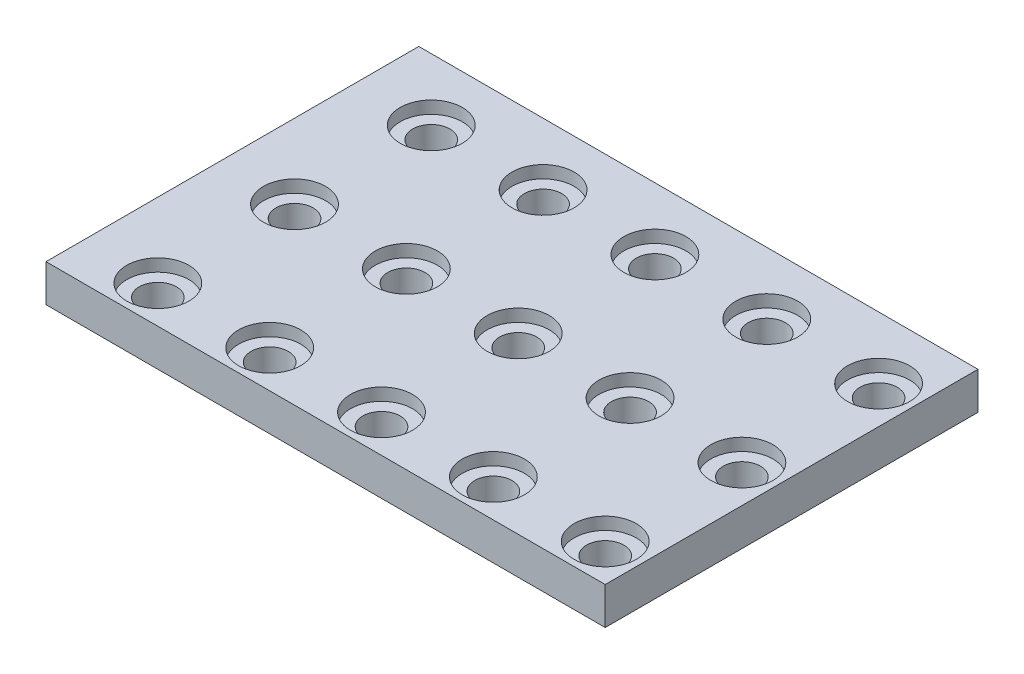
ISO-10303-21;
HEADER;
FILE_DESCRIPTION(('STEP AP214'),'2;1');
FILE_NAME('part.step','',(''),(''),'','','');
FILE_SCHEMA(('AUTOMOTIVE_DESIGN { 1 0 10303 214 1 1 1 1 }'));
ENDSEC;
DATA;
#1=APPLICATION_CONTEXT('core data for automotive mechanical design processes');
#2=APPLICATION_PROTOCOL_DEFINITION('international standard','automotive_design',2000,#1);
#3=PRODUCT_CONTEXT('',#1,'mechanical');
#4=PRODUCT('Part','Part','',(#3));
#5=PRODUCT_RELATED_PRODUCT_CATEGORY('part','',(#4));
#6=PRODUCT_DEFINITION_FORMATION('','',#4);
#7=PRODUCT_DEFINITION_CONTEXT('part definition',#1,'design');
#8=PRODUCT_DEFINITION('design','',#6,#7);
#9=PRODUCT_DEFINITION_SHAPE('','',#8);
#10=(LENGTH_UNIT() NAMED_UNIT(*) SI_UNIT(.MILLI.,.METRE.));
#11=(NAMED_UNIT(*) PLANE_ANGLE_UNIT() SI_UNIT($,.RADIAN.));
#12=(NAMED_UNIT(*) SI_UNIT($,.STERADIAN.) SOLID_ANGLE_UNIT());
#13=UNCERTAINTY_MEASURE_WITH_UNIT(LENGTH_MEASURE(1.E-05),#10,'distance_accuracy_value','');
#14=(GEOMETRIC_REPRESENTATION_CONTEXT(3) GLOBAL_UNCERTAINTY_ASSIGNED_CONTEXT((#13)) GLOBAL_UNIT_ASSIGNED_CONTEXT((#10,
#11,#12)) REPRESENTATION_CONTEXT('',''));
#15=CARTESIAN_POINT('',(0.,0.,0.));
#16=DIRECTION('',(0.,0.,1.));
#17=DIRECTION('',(1.,0.,0.));
#18=AXIS2_PLACEMENT_3D('',#15,#16,#17);
#19=CARTESIAN_POINT('',(6.00000000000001,0.,5.));
#20=DIRECTION('',(0.,1.,0.));
#21=DIRECTION('',(0.,0.,1.));
#22=AXIS2_PLACEMENT_3D('',#19,#20,#21);
#23=CYLINDRICAL_SURFACE('',#22,1.5);
#24=CARTESIAN_POINT('',(6.00000000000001,0.,5.));
#25=DIRECTION('',(0.,1.,0.));
#26=DIRECTION('',(0.,0.,1.));
#27=AXIS2_PLACEMENT_3D('',#24,#25,#26);
#28=CIRCLE('',#27,1.5);
#29=CARTESIAN_POINT('',(6.00000000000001,0.,6.50000000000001));
#30=VERTEX_POINT('',#29);
#31=EDGE_CURVE('E119',#30,#30,#28,.T.);
#32=ORIENTED_EDGE('',*,*,#31,.F.);
#33=EDGE_LOOP('',(#32));
#34=FACE_BOUND('',#33,.T.);
#35=CARTESIAN_POINT('',(6.00000000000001,2.,5.));
#36=DIRECTION('',(0.,1.,0.));
#37=DIRECTION('',(0.,0.,1.));
#38=AXIS2_PLACEMENT_3D('',#35,#36,#37);
#39=CIRCLE('',#38,1.5);
#40=CARTESIAN_POINT('',(6.00000000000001,2.,6.50000000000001));
#41=VERTEX_POINT('',#40);
#42=EDGE_CURVE('E37',#41,#41,#39,.F.);
#43=ORIENTED_EDGE('',*,*,#42,.F.);
#44=EDGE_LOOP('',(#43));
#45=FACE_BOUND('',#44,.T.);
#46=ADVANCED_FACE('F33',(#34,#45),#23,.F.);
#47=CARTESIAN_POINT('',(6.00000000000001,0.,16.));
#48=DIRECTION('',(0.,1.,0.));
#49=DIRECTION('',(0.,0.,1.));
#50=AXIS2_PLACEMENT_3D('',#47,#48,#49);
#51=CYLINDRICAL_SURFACE('',#50,1.5);
#52=CARTESIAN_POINT('',(6.00000000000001,0.,16.));
#53=DIRECTION('',(0.,1.,0.));
#54=DIRECTION('',(0.,0.,1.));
#55=AXIS2_PLACEMENT_3D('',#52,#53,#54);
#56=CIRCLE('',#55,1.5);
#57=CARTESIAN_POINT('',(6.00000000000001,0.,17.5));
#58=VERTEX_POINT('',#57);
#59=EDGE_CURVE('E240',#58,#58,#56,.T.);
#60=ORIENTED_EDGE('',*,*,#59,.F.);
#61=EDGE_LOOP('',(#60));
#62=FACE_BOUND('',#61,.T.);
#63=CARTESIAN_POINT('',(6.00000000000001,2.,16.));
#64=DIRECTION('',(0.,1.,0.));
#65=DIRECTION('',(0.,0.,1.));
#66=AXIS2_PLACEMENT_3D('',#63,#64,#65);
#67=CIRCLE('',#66,1.5);
#68=CARTESIAN_POINT('',(6.00000000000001,2.,17.5));
#69=VERTEX_POINT('',#68);
#70=EDGE_CURVE('E175',#69,#69,#67,.F.);
#71=ORIENTED_EDGE('',*,*,#70,.F.);
#72=EDGE_LOOP('',(#71));
#73=FACE_BOUND('',#72,.T.);
#74=ADVANCED_FACE('F309',(#62,#73),#51,.F.);
#75=CARTESIAN_POINT('',(6.00000000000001,0.,27.));
#76=DIRECTION('',(0.,1.,0.));
#77=DIRECTION('',(0.,0.,1.));
#78=AXIS2_PLACEMENT_3D('',#75,#76,#77);
#79=CYLINDRICAL_SURFACE('',#78,1.5);
#80=CARTESIAN_POINT('',(6.00000000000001,0.,27.));
#81=DIRECTION('',(0.,1.,0.));
#82=DIRECTION('',(0.,0.,1.));
#83=AXIS2_PLACEMENT_3D('',#80,#81,#82);
#84=CIRCLE('',#83,1.5);
#85=CARTESIAN_POINT('',(6.00000000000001,0.,28.5));
#86=VERTEX_POINT('',#85);
#87=EDGE_CURVE('E243',#86,#86,#84,.T.);
#88=ORIENTED_EDGE('',*,*,#87,.F.);
#89=EDGE_LOOP('',(#88));
#90=FACE_BOUND('',#89,.T.);
#91=CARTESIAN_POINT('',(6.00000000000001,2.,27.));
#92=DIRECTION('',(0.,1.,0.));
#93=DIRECTION('',(0.,0.,1.));
#94=AXIS2_PLACEMENT_3D('',#91,#92,#93);
#95=CIRCLE('',#94,1.5);
#96=CARTESIAN_POINT('',(6.00000000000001,2.,28.5));
#97=VERTEX_POINT('',#96);
#98=EDGE_CURVE('E171',#97,#97,#95,.F.);
#99=ORIENTED_EDGE('',*,*,#98,.F.);
#100=EDGE_LOOP('',(#99));
#101=FACE_BOUND('',#100,.T.);
#102=ADVANCED_FACE('F315',(#90,#101),#79,.F.);
#103=CARTESIAN_POINT('',(15.,0.,5.));
#104=DIRECTION('',(0.,1.,0.));
#105=DIRECTION('',(0.,0.,1.));
#106=AXIS2_PLACEMENT_3D('',#103,#104,#105);
#107=CYLINDRICAL_SURFACE('',#106,1.5);
#108=CARTESIAN_POINT('',(15.,0.,5.));
#109=DIRECTION('',(0.,1.,0.));
#110=DIRECTION('',(0.,0.,1.));
#111=AXIS2_PLACEMENT_3D('',#108,#109,#110);
#112=CIRCLE('',#111,1.5);
#113=CARTESIAN_POINT('',(15.,0.,6.50000000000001));
#114=VERTEX_POINT('',#113);
#115=EDGE_CURVE('E246',#114,#114,#112,.T.);
#116=ORIENTED_EDGE('',*,*,#115,.F.);
#117=EDGE_LOOP('',(#116));
#118=FACE_BOUND('',#117,.T.);
#119=CARTESIAN_POINT('',(15.,2.,5.));
#120=DIRECTION('',(0.,1.,0.));
#121=DIRECTION('',(0.,0.,1.));
#122=AXIS2_PLACEMENT_3D('',#119,#120,#121);
#123=CIRCLE('',#122,1.5);
#124=CARTESIAN_POINT('',(15.,2.,6.50000000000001));
#125=VERTEX_POINT('',#124);
#126=EDGE_CURVE('E166',#125,#125,#123,.F.);
#127=ORIENTED_EDGE('',*,*,#126,.F.);
#128=EDGE_LOOP('',(#127));
#129=FACE_BOUND('',#128,.T.);
#130=ADVANCED_FACE('F326',(#118,#129),#107,.F.);
#131=CARTESIAN_POINT('',(15.,0.,16.));
#132=DIRECTION('',(0.,1.,0.));
#133=DIRECTION('',(0.,0.,1.));
#134=AXIS2_PLACEMENT_3D('',#131,#132,#133);
#135=CYLINDRICAL_SURFACE('',#134,1.5);
#136=CARTESIAN_POINT('',(15.,0.,16.));
#137=DIRECTION('',(0.,1.,0.));
#138=DIRECTION('',(0.,0.,1.));
#139=AXIS2_PLACEMENT_3D('',#136,#137,#138);
#140=CIRCLE('',#139,1.5);
#141=CARTESIAN_POINT('',(15.,0.,17.5));
#142=VERTEX_POINT('',#141);
#143=EDGE_CURVE('E249',#142,#142,#140,.T.);
#144=ORIENTED_EDGE('',*,*,#143,.F.);
#145=EDGE_LOOP('',(#144));
#146=FACE_BOUND('',#145,.T.);
#147=CARTESIAN_POINT('',(15.,2.,16.));
#148=DIRECTION('',(0.,1.,0.));
#149=DIRECTION('',(0.,0.,1.));
#150=AXIS2_PLACEMENT_3D('',#147,#148,#149);
#151=CIRCLE('',#150,1.5);
#152=CARTESIAN_POINT('',(15.,2.,17.5));
#153=VERTEX_POINT('',#152);
#154=EDGE_CURVE('E161',#153,#153,#151,.F.);
#155=ORIENTED_EDGE('',*,*,#154,.F.);
#156=EDGE_LOOP('',(#155));
#157=FACE_BOUND('',#156,.T.);
#158=ADVANCED_FACE('F330',(#146,#157),#135,.F.);
#159=CARTESIAN_POINT('',(15.,0.,27.));
#160=DIRECTION('',(0.,1.,0.));
#161=DIRECTION('',(0.,0.,1.));
#162=AXIS2_PLACEMENT_3D('',#159,#160,#161);
#163=CYLINDRICAL_SURFACE('',#162,1.5);
#164=CARTESIAN_POINT('',(15.,0.,27.));
#165=DIRECTION('',(0.,1.,0.));
#166=DIRECTION('',(0.,0.,1.));
#167=AXIS2_PLACEMENT_3D('',#164,#165,#166);
#168=CIRCLE('',#167,1.5);
#169=CARTESIAN_POINT('',(15.,0.,28.5));
#170=VERTEX_POINT('',#169);
#171=EDGE_CURVE('E252',#170,#170,#168,.T.);
#172=ORIENTED_EDGE('',*,*,#171,.F.);
#173=EDGE_LOOP('',(#172));
#174=FACE_BOUND('',#173,.T.);
#175=CARTESIAN_POINT('',(15.,2.,27.));
#176=DIRECTION('',(0.,1.,0.));
#177=DIRECTION('',(0.,0.,1.));
#178=AXIS2_PLACEMENT_3D('',#175,#176,#177);
#179=CIRCLE('',#178,1.5);
#180=CARTESIAN_POINT('',(15.,2.,28.5));
#181=VERTEX_POINT('',#180);
#182=EDGE_CURVE('E156',#181,#181,#179,.F.);
#183=ORIENTED_EDGE('',*,*,#182,.F.);
#184=EDGE_LOOP('',(#183));
#185=FACE_BOUND('',#184,.T.);
#186=ADVANCED_FACE('F334',(#174,#185),#163,.F.);
#187=CARTESIAN_POINT('',(24.,0.,5.));
#188=DIRECTION('',(0.,1.,0.));
#189=DIRECTION('',(0.,0.,1.));
#190=AXIS2_PLACEMENT_3D('',#187,#188,#189);
#191=CYLINDRICAL_SURFACE('',#190,1.5);
#192=CARTESIAN_POINT('',(24.,0.,5.));
#193=DIRECTION('',(0.,1.,0.));
#194=DIRECTION('',(0.,0.,1.));
#195=AXIS2_PLACEMENT_3D('',#192,#193,#194);
#196=CIRCLE('',#195,1.5);
#197=CARTESIAN_POINT('',(24.,0.,6.50000000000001));
#198=VERTEX_POINT('',#197);
#199=EDGE_CURVE('E255',#198,#198,#196,.T.);
#200=ORIENTED_EDGE('',*,*,#199,.F.);
#201=EDGE_LOOP('',(#200));
#202=FACE_BOUND('',#201,.T.);
#203=CARTESIAN_POINT('',(24.,2.,5.));
#204=DIRECTION('',(0.,1.,0.));
#205=DIRECTION('',(0.,0.,1.));
#206=AXIS2_PLACEMENT_3D('',#203,#204,#205);
#207=CIRCLE('',#206,1.5);
#208=CARTESIAN_POINT('',(24.,2.,6.50000000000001));
#209=VERTEX_POINT('',#208);
#210=EDGE_CURVE('E151',#209,#209,#207,.F.);
#211=ORIENTED_EDGE('',*,*,#210,.F.);
#212=EDGE_LOOP('',(#211));
#213=FACE_BOUND('',#212,.T.);
#214=ADVANCED_FACE('F338',(#202,#213),#191,.F.);
#215=CARTESIAN_POINT('',(24.,0.,16.));
#216=DIRECTION('',(0.,1.,0.));
#217=DIRECTION('',(0.,0.,1.));
#218=AXIS2_PLACEMENT_3D('',#215,#216,#217);
#219=CYLINDRICAL_SURFACE('',#218,1.5);
#220=CARTESIAN_POINT('',(24.,0.,16.));
#221=DIRECTION('',(0.,1.,0.));
#222=DIRECTION('',(0.,0.,1.));
#223=AXIS2_PLACEMENT_3D('',#220,#221,#222);
#224=CIRCLE('',#223,1.5);
#225=CARTESIAN_POINT('',(24.,0.,17.5));
#226=VERTEX_POINT('',#225);
#227=EDGE_CURVE('E258',#226,#226,#224,.T.);
#228=ORIENTED_EDGE('',*,*,#227,.F.);
#229=EDGE_LOOP('',(#228));
#230=FACE_BOUND('',#229,.T.);
#231=CARTESIAN_POINT('',(24.,2.,16.));
#232=DIRECTION('',(0.,1.,0.));
#233=DIRECTION('',(0.,0.,1.));
#234=AXIS2_PLACEMENT_3D('',#231,#232,#233);
#235=CIRCLE('',#234,1.5);
#236=CARTESIAN_POINT('',(24.,2.,17.5));
#237=VERTEX_POINT('',#236);
#238=EDGE_CURVE('E146',#237,#237,#235,.F.);
#239=ORIENTED_EDGE('',*,*,#238,.F.);
#240=EDGE_LOOP('',(#239));
#241=FACE_BOUND('',#240,.T.);
#242=ADVANCED_FACE('F342',(#230,#241),#219,.F.);
#243=CARTESIAN_POINT('',(24.,0.,27.));
#244=DIRECTION('',(0.,1.,0.));
#245=DIRECTION('',(0.,0.,1.));
#246=AXIS2_PLACEMENT_3D('',#243,#244,#245);
#247=CYLINDRICAL_SURFACE('',#246,1.5);
#248=CARTESIAN_POINT('',(24.,0.,27.));
#249=DIRECTION('',(0.,1.,0.));
#250=DIRECTION('',(0.,0.,1.));
#251=AXIS2_PLACEMENT_3D('',#248,#249,#250);
#252=CIRCLE('',#251,1.5);
#253=CARTESIAN_POINT('',(24.,0.,28.5));
#254=VERTEX_POINT('',#253);
#255=EDGE_CURVE('E261',#254,#254,#252,.T.);
#256=ORIENTED_EDGE('',*,*,#255,.F.);
#257=EDGE_LOOP('',(#256));
#258=FACE_BOUND('',#257,.T.);
#259=CARTESIAN_POINT('',(24.,2.,27.));
#260=DIRECTION('',(0.,1.,0.));
#261=DIRECTION('',(0.,0.,1.));
#262=AXIS2_PLACEMENT_3D('',#259,#260,#261);
#263=CIRCLE('',#262,1.5);
#264=CARTESIAN_POINT('',(24.,2.,28.5));
#265=VERTEX_POINT('',#264);
#266=EDGE_CURVE('E141',#265,#265,#263,.F.);
#267=ORIENTED_EDGE('',*,*,#266,.F.);
#268=EDGE_LOOP('',(#267));
#269=FACE_BOUND('',#268,.T.);
#270=ADVANCED_FACE('F346',(#258,#269),#247,.F.);
#271=CARTESIAN_POINT('',(33.,0.,5.));
#272=DIRECTION('',(0.,1.,0.));
#273=DIRECTION('',(0.,0.,1.));
#274=AXIS2_PLACEMENT_3D('',#271,#272,#273);
#275=CYLINDRICAL_SURFACE('',#274,1.5);
#276=CARTESIAN_POINT('',(33.,0.,5.));
#277=DIRECTION('',(0.,1.,0.));
#278=DIRECTION('',(0.,0.,1.));
#279=AXIS2_PLACEMENT_3D('',#276,#277,#278);
#280=CIRCLE('',#279,1.5);
#281=CARTESIAN_POINT('',(33.,0.,6.50000000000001));
#282=VERTEX_POINT('',#281);
#283=EDGE_CURVE('E264',#282,#282,#280,.T.);
#284=ORIENTED_EDGE('',*,*,#283,.F.);
#285=EDGE_LOOP('',(#284));
#286=FACE_BOUND('',#285,.T.);
#287=CARTESIAN_POINT('',(33.,2.,5.));
#288=DIRECTION('',(0.,1.,0.));
#289=DIRECTION('',(0.,0.,1.));
#290=AXIS2_PLACEMENT_3D('',#287,#288,#289);
#291=CIRCLE('',#290,1.5);
#292=CARTESIAN_POINT('',(33.,2.,6.50000000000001));
#293=VERTEX_POINT('',#292);
#294=EDGE_CURVE('E136',#293,#293,#291,.F.);
#295=ORIENTED_EDGE('',*,*,#294,.F.);
#296=EDGE_LOOP('',(#295));
#297=FACE_BOUND('',#296,.T.);
#298=ADVANCED_FACE('F350',(#286,#297),#275,.F.);
#299=CARTESIAN_POINT('',(33.,0.,16.));
#300=DIRECTION('',(0.,1.,0.));
#301=DIRECTION('',(0.,0.,1.));
#302=AXIS2_PLACEMENT_3D('',#299,#300,#301);
#303=CYLINDRICAL_SURFACE('',#302,1.5);
#304=CARTESIAN_POINT('',(33.,0.,16.));
#305=DIRECTION('',(0.,1.,0.));
#306=DIRECTION('',(0.,0.,1.));
#307=AXIS2_PLACEMENT_3D('',#304,#305,#306);
#308=CIRCLE('',#307,1.5);
#309=CARTESIAN_POINT('',(33.,0.,17.5));
#310=VERTEX_POINT('',#309);
#311=EDGE_CURVE('E267',#310,#310,#308,.T.);
#312=ORIENTED_EDGE('',*,*,#311,.F.);
#313=EDGE_LOOP('',(#312));
#314=FACE_BOUND('',#313,.T.);
#315=CARTESIAN_POINT('',(33.,2.,16.));
#316=DIRECTION('',(0.,1.,0.));
#317=DIRECTION('',(0.,0.,1.));
#318=AXIS2_PLACEMENT_3D('',#315,#316,#317);
#319=CIRCLE('',#318,1.5);
#320=CARTESIAN_POINT('',(33.,2.,17.5));
#321=VERTEX_POINT('',#320);
#322=EDGE_CURVE('E131',#321,#321,#319,.F.);
#323=ORIENTED_EDGE('',*,*,#322,.F.);
#324=EDGE_LOOP('',(#323));
#325=FACE_BOUND('',#324,.T.);
#326=ADVANCED_FACE('F354',(#314,#325),#303,.F.);
#327=CARTESIAN_POINT('',(33.,0.,27.));
#328=DIRECTION('',(0.,1.,0.));
#329=DIRECTION('',(0.,0.,1.));
#330=AXIS2_PLACEMENT_3D('',#327,#328,#329);
#331=CYLINDRICAL_SURFACE('',#330,1.5);
#332=CARTESIAN_POINT('',(33.,0.,27.));
#333=DIRECTION('',(0.,1.,0.));
#334=DIRECTION('',(0.,0.,1.));
#335=AXIS2_PLACEMENT_3D('',#332,#333,#334);
#336=CIRCLE('',#335,1.5);
#337=CARTESIAN_POINT('',(33.,0.,28.5));
#338=VERTEX_POINT('',#337);
#339=EDGE_CURVE('E270',#338,#338,#336,.T.);
#340=ORIENTED_EDGE('',*,*,#339,.F.);
#341=EDGE_LOOP('',(#340));
#342=FACE_BOUND('',#341,.T.);
#343=CARTESIAN_POINT('',(33.,2.,27.));
#344=DIRECTION('',(0.,1.,0.));
#345=DIRECTION('',(0.,0.,1.));
#346=AXIS2_PLACEMENT_3D('',#343,#344,#345);
#347=CIRCLE('',#346,1.5);
#348=CARTESIAN_POINT('',(33.,2.,28.5));
#349=VERTEX_POINT('',#348);
#350=EDGE_CURVE('E126',#349,#349,#347,.F.);
#351=ORIENTED_EDGE('',*,*,#350,.F.);
#352=EDGE_LOOP('',(#351));
#353=FACE_BOUND('',#352,.T.);
#354=ADVANCED_FACE('F358',(#342,#353),#331,.F.);
#355=CARTESIAN_POINT('',(42.,0.,5.));
#356=DIRECTION('',(0.,1.,0.));
#357=DIRECTION('',(0.,0.,1.));
#358=AXIS2_PLACEMENT_3D('',#355,#356,#357);
#359=CYLINDRICAL_SURFACE('',#358,1.5);
#360=CARTESIAN_POINT('',(42.,0.,5.));
#361=DIRECTION('',(0.,1.,0.));
#362=DIRECTION('',(0.,0.,1.));
#363=AXIS2_PLACEMENT_3D('',#360,#361,#362);
#364=CIRCLE('',#363,1.5);
#365=CARTESIAN_POINT('',(42.,0.,6.50000000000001));
#366=VERTEX_POINT('',#365);
#367=EDGE_CURVE('E273',#366,#366,#364,.T.);
#368=ORIENTED_EDGE('',*,*,#367,.F.);
#369=EDGE_LOOP('',(#368));
#370=FACE_BOUND('',#369,.T.);
#371=CARTESIAN_POINT('',(42.,2.,5.));
#372=DIRECTION('',(0.,1.,0.));
#373=DIRECTION('',(0.,0.,1.));
#374=AXIS2_PLACEMENT_3D('',#371,#372,#373);
#375=CIRCLE('',#374,1.5);
#376=CARTESIAN_POINT('',(42.,2.,6.50000000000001));
#377=VERTEX_POINT('',#376);
#378=EDGE_CURVE('E121',#377,#377,#375,.F.);
#379=ORIENTED_EDGE('',*,*,#378,.F.);
#380=EDGE_LOOP('',(#379));
#381=FACE_BOUND('',#380,.T.);
#382=ADVANCED_FACE('F362',(#370,#381),#359,.F.);
#383=CARTESIAN_POINT('',(42.,0.,16.));
#384=DIRECTION('',(0.,1.,0.));
#385=DIRECTION('',(0.,0.,1.));
#386=AXIS2_PLACEMENT_3D('',#383,#384,#385);
#387=CYLINDRICAL_SURFACE('',#386,1.5);
#388=CARTESIAN_POINT('',(42.,0.,16.));
#389=DIRECTION('',(0.,1.,0.));
#390=DIRECTION('',(0.,0.,1.));
#391=AXIS2_PLACEMENT_3D('',#388,#389,#390);
#392=CIRCLE('',#391,1.5);
#393=CARTESIAN_POINT('',(42.,0.,17.5));
#394=VERTEX_POINT('',#393);
#395=EDGE_CURVE('E276',#394,#394,#392,.T.);
#396=ORIENTED_EDGE('',*,*,#395,.F.);
#397=EDGE_LOOP('',(#396));
#398=FACE_BOUND('',#397,.T.);
#399=CARTESIAN_POINT('',(42.,2.,16.));
#400=DIRECTION('',(0.,1.,0.));
#401=DIRECTION('',(0.,0.,1.));
#402=AXIS2_PLACEMENT_3D('',#399,#400,#401);
#403=CIRCLE('',#402,1.5);
#404=CARTESIAN_POINT('',(42.,2.,17.5));
#405=VERTEX_POINT('',#404);
#406=EDGE_CURVE('E116',#405,#405,#403,.F.);
#407=ORIENTED_EDGE('',*,*,#406,.F.);
#408=EDGE_LOOP('',(#407));
#409=FACE_BOUND('',#408,.T.);
#410=ADVANCED_FACE('F366',(#398,#409),#387,.F.);
#411=CARTESIAN_POINT('',(42.,0.,27.));
#412=DIRECTION('',(0.,1.,0.));
#413=DIRECTION('',(0.,0.,1.));
#414=AXIS2_PLACEMENT_3D('',#411,#412,#413);
#415=CYLINDRICAL_SURFACE('',#414,1.5);
#416=CARTESIAN_POINT('',(42.,0.,27.));
#417=DIRECTION('',(0.,1.,0.));
#418=DIRECTION('',(0.,0.,1.));
#419=AXIS2_PLACEMENT_3D('',#416,#417,#418);
#420=CIRCLE('',#419,1.5);
#421=CARTESIAN_POINT('',(42.,0.,28.5));
#422=VERTEX_POINT('',#421);
#423=EDGE_CURVE('E93',#422,#422,#420,.T.);
#424=ORIENTED_EDGE('',*,*,#423,.F.);
#425=EDGE_LOOP('',(#424));
#426=FACE_BOUND('',#425,.T.);
#427=CARTESIAN_POINT('',(42.,2.,27.));
#428=DIRECTION('',(0.,1.,0.));
#429=DIRECTION('',(0.,0.,1.));
#430=AXIS2_PLACEMENT_3D('',#427,#428,#429);
#431=CIRCLE('',#430,1.5);
#432=CARTESIAN_POINT('',(42.,2.,28.5));
#433=VERTEX_POINT('',#432);
#434=EDGE_CURVE('E96',#433,#433,#431,.F.);
#435=ORIENTED_EDGE('',*,*,#434,.F.);
#436=EDGE_LOOP('',(#435));
#437=FACE_BOUND('',#436,.T.);
#438=ADVANCED_FACE('F370',(#426,#437),#415,.F.);
#439=CARTESIAN_POINT('',(0.,3.,0.));
#440=DIRECTION('',(1.,0.,0.));
#441=DIRECTION('',(0.,0.,-1.));
#442=AXIS2_PLACEMENT_3D('',#439,#440,#441);
#443=PLANE('',#442);
#444=DIRECTION('',(0.,0.,1.));
#445=VECTOR('',#444,1.);
#446=CARTESIAN_POINT('',(0.,0.,0.));
#447=LINE('',#446,#445);
#448=CARTESIAN_POINT('',(0.,0.,0.));
#449=VERTEX_POINT('',#448);
#450=CARTESIAN_POINT('',(0.,0.,30.));
#451=VERTEX_POINT('',#450);
#452=EDGE_CURVE('E80',#449,#451,#447,.T.);
#453=ORIENTED_EDGE('',*,*,#452,.T.);
#454=DIRECTION('',(0.,-1.,0.));
#455=VECTOR('',#454,1.);
#456=CARTESIAN_POINT('',(0.,3.,30.));
#457=LINE('',#456,#455);
#458=CARTESIAN_POINT('',(0.,3.,30.));
#459=VERTEX_POINT('',#458);
#460=EDGE_CURVE('E11',#459,#451,#457,.T.);
#461=ORIENTED_EDGE('',*,*,#460,.F.);
#462=DIRECTION('',(0.,0.,1.));
#463=VECTOR('',#462,1.);
#464=CARTESIAN_POINT('',(0.,3.,0.));
#465=LINE('',#464,#463);
#466=CARTESIAN_POINT('',(0.,3.,0.));
#467=VERTEX_POINT('',#466);
#468=EDGE_CURVE('E103',#467,#459,#465,.T.);
#469=ORIENTED_EDGE('',*,*,#468,.F.);
#470=DIRECTION('',(0.,-1.,0.));
#471=VECTOR('',#470,1.);
#472=CARTESIAN_POINT('',(0.,3.,0.));
#473=LINE('',#472,#471);
#474=EDGE_CURVE('E92',#467,#449,#473,.T.);
#475=ORIENTED_EDGE('',*,*,#474,.T.);
#476=EDGE_LOOP('',(#453,#461,#469,#475));
#477=FACE_BOUND('',#476,.T.);
#478=ADVANCED_FACE('F35',(#477),#443,.F.);
#479=CARTESIAN_POINT('',(0.,3.,30.));
#480=DIRECTION('',(0.,0.,-1.));
#481=DIRECTION('',(-1.,0.,0.));
#482=AXIS2_PLACEMENT_3D('',#479,#480,#481);
#483=PLANE('',#482);
#484=DIRECTION('',(1.,0.,0.));
#485=VECTOR('',#484,1.);
#486=CARTESIAN_POINT('',(0.,0.,30.));
#487=LINE('',#486,#485);
#488=CARTESIAN_POINT('',(45.,0.,30.));
#489=VERTEX_POINT('',#488);
#490=EDGE_CURVE('E76',#451,#489,#487,.T.);
#491=ORIENTED_EDGE('',*,*,#490,.T.);
#492=DIRECTION('',(0.,-1.,0.));
#493=VECTOR('',#492,1.);
#494=CARTESIAN_POINT('',(45.,3.,30.));
#495=LINE('',#494,#493);
#496=CARTESIAN_POINT('',(45.,3.,30.));
#497=VERTEX_POINT('',#496);
#498=EDGE_CURVE('E42',#497,#489,#495,.T.);
#499=ORIENTED_EDGE('',*,*,#498,.F.);
#500=DIRECTION('',(1.,0.,0.));
#501=VECTOR('',#500,1.);
#502=CARTESIAN_POINT('',(0.,3.,30.));
#503=LINE('',#502,#501);
#504=EDGE_CURVE('E88',#459,#497,#503,.T.);
#505=ORIENTED_EDGE('',*,*,#504,.F.);
#506=ORIENTED_EDGE('',*,*,#460,.T.);
#507=EDGE_LOOP('',(#491,#499,#505,#506));
#508=FACE_BOUND('',#507,.T.);
#509=ADVANCED_FACE('F87',(#508),#483,.F.);
#510=CARTESIAN_POINT('',(45.,3.,0.));
#511=DIRECTION('',(-1.,0.,0.));
#512=DIRECTION('',(0.,0.,1.));
#513=AXIS2_PLACEMENT_3D('',#510,#511,#512);
#514=PLANE('',#513);
#515=DIRECTION('',(0.,0.,-1.));
#516=VECTOR('',#515,1.);
#517=CARTESIAN_POINT('',(45.,0.,0.));
#518=LINE('',#517,#516);
#519=CARTESIAN_POINT('',(45.,0.,0.));
#520=VERTEX_POINT('',#519);
#521=EDGE_CURVE('E81',#489,#520,#518,.T.);
#522=ORIENTED_EDGE('',*,*,#521,.T.);
#523=DIRECTION('',(0.,-1.,0.));
#524=VECTOR('',#523,1.);
#525=CARTESIAN_POINT('',(45.,3.,0.));
#526=LINE('',#525,#524);
#527=CARTESIAN_POINT('',(45.,3.,0.));
#528=VERTEX_POINT('',#527);
#529=EDGE_CURVE('E109',#528,#520,#526,.T.);
#530=ORIENTED_EDGE('',*,*,#529,.F.);
#531=DIRECTION('',(0.,0.,-1.));
#532=VECTOR('',#531,1.);
#533=CARTESIAN_POINT('',(45.,3.,0.));
#534=LINE('',#533,#532);
#535=EDGE_CURVE('E55',#497,#528,#534,.T.);
#536=ORIENTED_EDGE('',*,*,#535,.F.);
#537=ORIENTED_EDGE('',*,*,#498,.T.);
#538=EDGE_LOOP('',(#522,#530,#536,#537));
#539=FACE_BOUND('',#538,.T.);
#540=ADVANCED_FACE('F300',(#539),#514,.F.);
#541=CARTESIAN_POINT('',(0.,3.,0.));
#542=DIRECTION('',(0.,0.,1.));
#543=DIRECTION('',(1.,0.,0.));
#544=AXIS2_PLACEMENT_3D('',#541,#542,#543);
#545=PLANE('',#544);
#546=DIRECTION('',(-1.,0.,0.));
#547=VECTOR('',#546,1.);
#548=CARTESIAN_POINT('',(0.,0.,0.));
#549=LINE('',#548,#547);
#550=EDGE_CURVE('E101',#520,#449,#549,.T.);
#551=ORIENTED_EDGE('',*,*,#550,.T.);
#552=ORIENTED_EDGE('',*,*,#474,.F.);
#553=DIRECTION('',(-1.,0.,0.));
#554=VECTOR('',#553,1.);
#555=CARTESIAN_POINT('',(0.,3.,0.));
#556=LINE('',#555,#554);
#557=EDGE_CURVE('E50',#528,#467,#556,.T.);
#558=ORIENTED_EDGE('',*,*,#557,.F.);
#559=ORIENTED_EDGE('',*,*,#529,.T.);
#560=EDGE_LOOP('',(#551,#552,#558,#559));
#561=FACE_BOUND('',#560,.T.);
#562=ADVANCED_FACE('F296',(#561),#545,.F.);
#563=CARTESIAN_POINT('',(0.,3.,30.));
#564=DIRECTION('',(0.,1.,0.));
#565=DIRECTION('',(0.,0.,1.));
#566=AXIS2_PLACEMENT_3D('',#563,#564,#565);
#567=PLANE('',#566);
#568=CARTESIAN_POINT('',(6.00000000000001,3.,5.));
#569=DIRECTION('',(0.,1.,0.));
#570=DIRECTION('',(0.,0.,1.));
#571=AXIS2_PLACEMENT_3D('',#568,#569,#570);
#572=CIRCLE('',#571,2.5);
#573=CARTESIAN_POINT('',(6.00000000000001,3.,7.5));
#574=VERTEX_POINT('',#573);
#575=EDGE_CURVE('E531',#574,#574,#572,.T.);
#576=ORIENTED_EDGE('',*,*,#575,.F.);
#577=EDGE_LOOP('',(#576));
#578=FACE_BOUND('',#577,.T.);
#579=CARTESIAN_POINT('',(6.00000000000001,3.,16.));
#580=DIRECTION('',(0.,1.,0.));
#581=DIRECTION('',(0.,0.,1.));
#582=AXIS2_PLACEMENT_3D('',#579,#580,#581);
#583=CIRCLE('',#582,2.5);
#584=CARTESIAN_POINT('',(6.00000000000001,3.,18.5));
#585=VERTEX_POINT('',#584);
#586=EDGE_CURVE('E184',#585,#585,#583,.T.);
#587=ORIENTED_EDGE('',*,*,#586,.F.);
#588=EDGE_LOOP('',(#587));
#589=FACE_BOUND('',#588,.T.);
#590=CARTESIAN_POINT('',(6.00000000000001,3.,27.));
#591=DIRECTION('',(0.,1.,0.));
#592=DIRECTION('',(0.,0.,1.));
#593=AXIS2_PLACEMENT_3D('',#590,#591,#592);
#594=CIRCLE('',#593,2.5);
#595=CARTESIAN_POINT('',(6.00000000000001,3.,29.5));
#596=VERTEX_POINT('',#595);
#597=EDGE_CURVE('E177',#596,#596,#594,.T.);
#598=ORIENTED_EDGE('',*,*,#597,.F.);
#599=EDGE_LOOP('',(#598));
#600=FACE_BOUND('',#599,.T.);
#601=CARTESIAN_POINT('',(15.,3.,5.));
#602=DIRECTION('',(0.,1.,0.));
#603=DIRECTION('',(0.,0.,1.));
#604=AXIS2_PLACEMENT_3D('',#601,#602,#603);
#605=CIRCLE('',#604,2.5);
#606=CARTESIAN_POINT('',(15.,3.,7.5));
#607=VERTEX_POINT('',#606);
#608=EDGE_CURVE('E173',#607,#607,#605,.T.);
#609=ORIENTED_EDGE('',*,*,#608,.F.);
#610=EDGE_LOOP('',(#609));
#611=FACE_BOUND('',#610,.T.);
#612=CARTESIAN_POINT('',(15.,3.,16.));
#613=DIRECTION('',(0.,1.,0.));
#614=DIRECTION('',(0.,0.,1.));
#615=AXIS2_PLACEMENT_3D('',#612,#613,#614);
#616=CIRCLE('',#615,2.5);
#617=CARTESIAN_POINT('',(15.,3.,18.5));
#618=VERTEX_POINT('',#617);
#619=EDGE_CURVE('E169',#618,#618,#616,.T.);
#620=ORIENTED_EDGE('',*,*,#619,.F.);
#621=EDGE_LOOP('',(#620));
#622=FACE_BOUND('',#621,.T.);
#623=CARTESIAN_POINT('',(15.,3.,27.));
#624=DIRECTION('',(0.,1.,0.));
#625=DIRECTION('',(0.,0.,1.));
#626=AXIS2_PLACEMENT_3D('',#623,#624,#625);
#627=CIRCLE('',#626,2.5);
#628=CARTESIAN_POINT('',(15.,3.,29.5));
#629=VERTEX_POINT('',#628);
#630=EDGE_CURVE('E164',#629,#629,#627,.T.);
#631=ORIENTED_EDGE('',*,*,#630,.F.);
#632=EDGE_LOOP('',(#631));
#633=FACE_BOUND('',#632,.T.);
#634=CARTESIAN_POINT('',(24.,3.,5.));
#635=DIRECTION('',(0.,1.,0.));
#636=DIRECTION('',(0.,0.,1.));
#637=AXIS2_PLACEMENT_3D('',#634,#635,#636);
#638=CIRCLE('',#637,2.5);
#639=CARTESIAN_POINT('',(24.,3.,7.5));
#640=VERTEX_POINT('',#639);
#641=EDGE_CURVE('E159',#640,#640,#638,.T.);
#642=ORIENTED_EDGE('',*,*,#641,.F.);
#643=EDGE_LOOP('',(#642));
#644=FACE_BOUND('',#643,.T.);
#645=CARTESIAN_POINT('',(24.,3.,16.));
#646=DIRECTION('',(0.,1.,0.));
#647=DIRECTION('',(0.,0.,1.));
#648=AXIS2_PLACEMENT_3D('',#645,#646,#647);
#649=CIRCLE('',#648,2.5);
#650=CARTESIAN_POINT('',(24.,3.,18.5));
#651=VERTEX_POINT('',#650);
#652=EDGE_CURVE('E154',#651,#651,#649,.T.);
#653=ORIENTED_EDGE('',*,*,#652,.F.);
#654=EDGE_LOOP('',(#653));
#655=FACE_BOUND('',#654,.T.);
#656=CARTESIAN_POINT('',(24.,3.,27.));
#657=DIRECTION('',(0.,1.,0.));
#658=DIRECTION('',(0.,0.,1.));
#659=AXIS2_PLACEMENT_3D('',#656,#657,#658);
#660=CIRCLE('',#659,2.5);
#661=CARTESIAN_POINT('',(24.,3.,29.5));
#662=VERTEX_POINT('',#661);
#663=EDGE_CURVE('E149',#662,#662,#660,.T.);
#664=ORIENTED_EDGE('',*,*,#663,.F.);
#665=EDGE_LOOP('',(#664));
#666=FACE_BOUND('',#665,.T.);
#667=CARTESIAN_POINT('',(33.,3.,5.));
#668=DIRECTION('',(0.,1.,0.));
#669=DIRECTION('',(0.,0.,1.));
#670=AXIS2_PLACEMENT_3D('',#667,#668,#669);
#671=CIRCLE('',#670,2.5);
#672=CARTESIAN_POINT('',(33.,3.,7.5));
#673=VERTEX_POINT('',#672);
#674=EDGE_CURVE('E144',#673,#673,#671,.T.);
#675=ORIENTED_EDGE('',*,*,#674,.F.);
#676=EDGE_LOOP('',(#675));
#677=FACE_BOUND('',#676,.T.);
#678=CARTESIAN_POINT('',(33.,3.,16.));
#679=DIRECTION('',(0.,1.,0.));
#680=DIRECTION('',(0.,0.,1.));
#681=AXIS2_PLACEMENT_3D('',#678,#679,#680);
#682=CIRCLE('',#681,2.5);
#683=CARTESIAN_POINT('',(33.,3.,18.5));
#684=VERTEX_POINT('',#683);
#685=EDGE_CURVE('E139',#684,#684,#682,.T.);
#686=ORIENTED_EDGE('',*,*,#685,.F.);
#687=EDGE_LOOP('',(#686));
#688=FACE_BOUND('',#687,.T.);
#689=CARTESIAN_POINT('',(33.,3.,27.));
#690=DIRECTION('',(0.,1.,0.));
#691=DIRECTION('',(0.,0.,1.));
#692=AXIS2_PLACEMENT_3D('',#689,#690,#691);
#693=CIRCLE('',#692,2.5);
#694=CARTESIAN_POINT('',(33.,3.,29.5));
#695=VERTEX_POINT('',#694);
#696=EDGE_CURVE('E134',#695,#695,#693,.T.);
#697=ORIENTED_EDGE('',*,*,#696,.F.);
#698=EDGE_LOOP('',(#697));
#699=FACE_BOUND('',#698,.T.);
#700=CARTESIAN_POINT('',(42.,3.,5.));
#701=DIRECTION('',(0.,1.,0.));
#702=DIRECTION('',(0.,0.,1.));
#703=AXIS2_PLACEMENT_3D('',#700,#701,#702);
#704=CIRCLE('',#703,2.5);
#705=CARTESIAN_POINT('',(42.,3.,7.5));
#706=VERTEX_POINT('',#705);
#707=EDGE_CURVE('E129',#706,#706,#704,.T.);
#708=ORIENTED_EDGE('',*,*,#707,.F.);
#709=EDGE_LOOP('',(#708));
#710=FACE_BOUND('',#709,.T.);
#711=CARTESIAN_POINT('',(42.,3.,16.));
#712=DIRECTION('',(0.,1.,0.));
#713=DIRECTION('',(0.,0.,1.));
#714=AXIS2_PLACEMENT_3D('',#711,#712,#713);
#715=CIRCLE('',#714,2.5);
#716=CARTESIAN_POINT('',(42.,3.,18.5));
#717=VERTEX_POINT('',#716);
#718=EDGE_CURVE('E124',#717,#717,#715,.T.);
#719=ORIENTED_EDGE('',*,*,#718,.F.);
#720=EDGE_LOOP('',(#719));
#721=FACE_BOUND('',#720,.T.);
#722=CARTESIAN_POINT('',(42.,3.,27.));
#723=DIRECTION('',(0.,1.,0.));
#724=DIRECTION('',(0.,0.,1.));
#725=AXIS2_PLACEMENT_3D('',#722,#723,#724);
#726=CIRCLE('',#725,2.5);
#727=CARTESIAN_POINT('',(42.,3.,29.5));
#728=VERTEX_POINT('',#727);
#729=EDGE_CURVE('E279',#728,#728,#726,.T.);
#730=ORIENTED_EDGE('',*,*,#729,.F.);
#731=EDGE_LOOP('',(#730));
#732=FACE_BOUND('',#731,.T.);
#733=ORIENTED_EDGE('',*,*,#468,.T.);
#734=ORIENTED_EDGE('',*,*,#504,.T.);
#735=ORIENTED_EDGE('',*,*,#535,.T.);
#736=ORIENTED_EDGE('',*,*,#557,.T.);
#737=EDGE_LOOP('',(#733,#734,#735,#736));
#738=FACE_BOUND('',#737,.T.);
#739=ADVANCED_FACE('F294',(#578,#589,#600,#611,#622,#633,#644,#655,#666,#677,#688,#699,#710,
#721,#732,#738),#567,.T.);
#740=CARTESIAN_POINT('',(0.,0.,30.));
#741=DIRECTION('',(0.,1.,0.));
#742=DIRECTION('',(0.,0.,1.));
#743=AXIS2_PLACEMENT_3D('',#740,#741,#742);
#744=PLANE('',#743);
#745=ORIENTED_EDGE('',*,*,#31,.T.);
#746=EDGE_LOOP('',(#745));
#747=FACE_BOUND('',#746,.T.);
#748=ORIENTED_EDGE('',*,*,#59,.T.);
#749=EDGE_LOOP('',(#748));
#750=FACE_BOUND('',#749,.T.);
#751=ORIENTED_EDGE('',*,*,#87,.T.);
#752=EDGE_LOOP('',(#751));
#753=FACE_BOUND('',#752,.T.);
#754=ORIENTED_EDGE('',*,*,#115,.T.);
#755=EDGE_LOOP('',(#754));
#756=FACE_BOUND('',#755,.T.);
#757=ORIENTED_EDGE('',*,*,#143,.T.);
#758=EDGE_LOOP('',(#757));
#759=FACE_BOUND('',#758,.T.);
#760=ORIENTED_EDGE('',*,*,#171,.T.);
#761=EDGE_LOOP('',(#760));
#762=FACE_BOUND('',#761,.T.);
#763=ORIENTED_EDGE('',*,*,#199,.T.);
#764=EDGE_LOOP('',(#763));
#765=FACE_BOUND('',#764,.T.);
#766=ORIENTED_EDGE('',*,*,#227,.T.);
#767=EDGE_LOOP('',(#766));
#768=FACE_BOUND('',#767,.T.);
#769=ORIENTED_EDGE('',*,*,#255,.T.);
#770=EDGE_LOOP('',(#769));
#771=FACE_BOUND('',#770,.T.);
#772=ORIENTED_EDGE('',*,*,#283,.T.);
#773=EDGE_LOOP('',(#772));
#774=FACE_BOUND('',#773,.T.);
#775=ORIENTED_EDGE('',*,*,#311,.T.);
#776=EDGE_LOOP('',(#775));
#777=FACE_BOUND('',#776,.T.);
#778=ORIENTED_EDGE('',*,*,#339,.T.);
#779=EDGE_LOOP('',(#778));
#780=FACE_BOUND('',#779,.T.);
#781=ORIENTED_EDGE('',*,*,#367,.T.);
#782=EDGE_LOOP('',(#781));
#783=FACE_BOUND('',#782,.T.);
#784=ORIENTED_EDGE('',*,*,#395,.T.);
#785=EDGE_LOOP('',(#784));
#786=FACE_BOUND('',#785,.T.);
#787=ORIENTED_EDGE('',*,*,#423,.T.);
#788=EDGE_LOOP('',(#787));
#789=FACE_BOUND('',#788,.T.);
#790=ORIENTED_EDGE('',*,*,#452,.F.);
#791=ORIENTED_EDGE('',*,*,#550,.F.);
#792=ORIENTED_EDGE('',*,*,#521,.F.);
#793=ORIENTED_EDGE('',*,*,#490,.F.);
#794=EDGE_LOOP('',(#790,#791,#792,#793));
#795=FACE_BOUND('',#794,.T.);
#796=ADVANCED_FACE('F77',(#747,#750,#753,#756,#759,#762,#765,#768,#771,#774,#777,#780,#783,#786,
#789,#795),#744,.F.);
#797=CARTESIAN_POINT('',(42.,2.,27.));
#798=DIRECTION('',(0.,1.,0.));
#799=DIRECTION('',(0.,0.,1.));
#800=AXIS2_PLACEMENT_3D('',#797,#798,#799);
#801=PLANE('',#800);
#802=CARTESIAN_POINT('',(42.,2.,27.));
#803=DIRECTION('',(0.,1.,0.));
#804=DIRECTION('',(0.,0.,1.));
#805=AXIS2_PLACEMENT_3D('',#802,#803,#804);
#806=CIRCLE('',#805,2.5);
#807=CARTESIAN_POINT('',(42.,2.,29.5));
#808=VERTEX_POINT('',#807);
#809=EDGE_CURVE('E115',#808,#808,#806,.T.);
#810=ORIENTED_EDGE('',*,*,#809,.T.);
#811=EDGE_LOOP('',(#810));
#812=FACE_BOUND('',#811,.T.);
#813=ORIENTED_EDGE('',*,*,#434,.T.);
#814=EDGE_LOOP('',(#813));
#815=FACE_BOUND('',#814,.T.);
#816=ADVANCED_FACE('F284',(#812,#815),#801,.T.);
#817=CARTESIAN_POINT('',(42.,2.,27.));
#818=DIRECTION('',(0.,1.,0.));
#819=DIRECTION('',(0.,0.,1.));
#820=AXIS2_PLACEMENT_3D('',#817,#818,#819);
#821=CYLINDRICAL_SURFACE('',#820,2.5);
#822=ORIENTED_EDGE('',*,*,#809,.F.);
#823=EDGE_LOOP('',(#822));
#824=FACE_BOUND('',#823,.T.);
#825=ORIENTED_EDGE('',*,*,#729,.T.);
#826=EDGE_LOOP('',(#825));
#827=FACE_BOUND('',#826,.T.);
#828=ADVANCED_FACE('F287',(#824,#827),#821,.F.);
#829=CARTESIAN_POINT('',(42.,2.,16.));
#830=DIRECTION('',(0.,1.,0.));
#831=DIRECTION('',(0.,0.,1.));
#832=AXIS2_PLACEMENT_3D('',#829,#830,#831);
#833=PLANE('',#832);
#834=CARTESIAN_POINT('',(42.,2.,16.));
#835=DIRECTION('',(0.,1.,0.));
#836=DIRECTION('',(0.,0.,1.));
#837=AXIS2_PLACEMENT_3D('',#834,#835,#836);
#838=CIRCLE('',#837,2.5);
#839=CARTESIAN_POINT('',(42.,2.,18.5));
#840=VERTEX_POINT('',#839);
#841=EDGE_CURVE('E120',#840,#840,#838,.T.);
#842=ORIENTED_EDGE('',*,*,#841,.T.);
#843=EDGE_LOOP('',(#842));
#844=FACE_BOUND('',#843,.T.);
#845=ORIENTED_EDGE('',*,*,#406,.T.);
#846=EDGE_LOOP('',(#845));
#847=FACE_BOUND('',#846,.T.);
#848=ADVANCED_FACE('F290',(#844,#847),#833,.T.);
#849=CARTESIAN_POINT('',(42.,2.,16.));
#850=DIRECTION('',(0.,1.,0.));
#851=DIRECTION('',(0.,0.,1.));
#852=AXIS2_PLACEMENT_3D('',#849,#850,#851);
#853=CYLINDRICAL_SURFACE('',#852,2.5);
#854=ORIENTED_EDGE('',*,*,#841,.F.);
#855=EDGE_LOOP('',(#854));
#856=FACE_BOUND('',#855,.T.);
#857=ORIENTED_EDGE('',*,*,#718,.T.);
#858=EDGE_LOOP('',(#857));
#859=FACE_BOUND('',#858,.T.);
#860=ADVANCED_FACE('F321',(#856,#859),#853,.F.);
#861=CARTESIAN_POINT('',(42.,2.,5.));
#862=DIRECTION('',(0.,1.,0.));
#863=DIRECTION('',(0.,0.,1.));
#864=AXIS2_PLACEMENT_3D('',#861,#862,#863);
#865=PLANE('',#864);
#866=CARTESIAN_POINT('',(42.,2.,5.));
#867=DIRECTION('',(0.,1.,0.));
#868=DIRECTION('',(0.,0.,1.));
#869=AXIS2_PLACEMENT_3D('',#866,#867,#868);
#870=CIRCLE('',#869,2.5);
#871=CARTESIAN_POINT('',(42.,2.,7.5));
#872=VERTEX_POINT('',#871);
#873=EDGE_CURVE('E125',#872,#872,#870,.T.);
#874=ORIENTED_EDGE('',*,*,#873,.T.);
#875=EDGE_LOOP('',(#874));
#876=FACE_BOUND('',#875,.T.);
#877=ORIENTED_EDGE('',*,*,#378,.T.);
#878=EDGE_LOOP('',(#877));
#879=FACE_BOUND('',#878,.T.);
#880=ADVANCED_FACE('F419',(#876,#879),#865,.T.);
#881=CARTESIAN_POINT('',(42.,2.,5.));
#882=DIRECTION('',(0.,1.,0.));
#883=DIRECTION('',(0.,0.,1.));
#884=AXIS2_PLACEMENT_3D('',#881,#882,#883);
#885=CYLINDRICAL_SURFACE('',#884,2.5);
#886=ORIENTED_EDGE('',*,*,#873,.F.);
#887=EDGE_LOOP('',(#886));
#888=FACE_BOUND('',#887,.T.);
#889=ORIENTED_EDGE('',*,*,#707,.T.);
#890=EDGE_LOOP('',(#889));
#891=FACE_BOUND('',#890,.T.);
#892=ADVANCED_FACE('F422',(#888,#891),#885,.F.);
#893=CARTESIAN_POINT('',(33.,2.,27.));
#894=DIRECTION('',(0.,1.,0.));
#895=DIRECTION('',(0.,0.,1.));
#896=AXIS2_PLACEMENT_3D('',#893,#894,#895);
#897=PLANE('',#896);
#898=CARTESIAN_POINT('',(33.,2.,27.));
#899=DIRECTION('',(0.,1.,0.));
#900=DIRECTION('',(0.,0.,1.));
#901=AXIS2_PLACEMENT_3D('',#898,#899,#900);
#902=CIRCLE('',#901,2.5);
#903=CARTESIAN_POINT('',(33.,2.,29.5));
#904=VERTEX_POINT('',#903);
#905=EDGE_CURVE('E130',#904,#904,#902,.T.);
#906=ORIENTED_EDGE('',*,*,#905,.T.);
#907=EDGE_LOOP('',(#906));
#908=FACE_BOUND('',#907,.T.);
#909=ORIENTED_EDGE('',*,*,#350,.T.);
#910=EDGE_LOOP('',(#909));
#911=FACE_BOUND('',#910,.T.);
#912=ADVANCED_FACE('F425',(#908,#911),#897,.T.);
#913=CARTESIAN_POINT('',(33.,2.,27.));
#914=DIRECTION('',(0.,1.,0.));
#915=DIRECTION('',(0.,0.,1.));
#916=AXIS2_PLACEMENT_3D('',#913,#914,#915);
#917=CYLINDRICAL_SURFACE('',#916,2.5);
#918=ORIENTED_EDGE('',*,*,#905,.F.);
#919=EDGE_LOOP('',(#918));
#920=FACE_BOUND('',#919,.T.);
#921=ORIENTED_EDGE('',*,*,#696,.T.);
#922=EDGE_LOOP('',(#921));
#923=FACE_BOUND('',#922,.T.);
#924=ADVANCED_FACE('F430',(#920,#923),#917,.F.);
#925=CARTESIAN_POINT('',(33.,2.,16.));
#926=DIRECTION('',(0.,1.,0.));
#927=DIRECTION('',(0.,0.,1.));
#928=AXIS2_PLACEMENT_3D('',#925,#926,#927);
#929=PLANE('',#928);
#930=CARTESIAN_POINT('',(33.,2.,16.));
#931=DIRECTION('',(0.,1.,0.));
#932=DIRECTION('',(0.,0.,1.));
#933=AXIS2_PLACEMENT_3D('',#930,#931,#932);
#934=CIRCLE('',#933,2.5);
#935=CARTESIAN_POINT('',(33.,2.,18.5));
#936=VERTEX_POINT('',#935);
#937=EDGE_CURVE('E135',#936,#936,#934,.T.);
#938=ORIENTED_EDGE('',*,*,#937,.T.);
#939=EDGE_LOOP('',(#938));
#940=FACE_BOUND('',#939,.T.);
#941=ORIENTED_EDGE('',*,*,#322,.T.);
#942=EDGE_LOOP('',(#941));
#943=FACE_BOUND('',#942,.T.);
#944=ADVANCED_FACE('F433',(#940,#943),#929,.T.);
#945=CARTESIAN_POINT('',(33.,2.,16.));
#946=DIRECTION('',(0.,1.,0.));
#947=DIRECTION('',(0.,0.,1.));
#948=AXIS2_PLACEMENT_3D('',#945,#946,#947);
#949=CYLINDRICAL_SURFACE('',#948,2.5);
#950=ORIENTED_EDGE('',*,*,#937,.F.);
#951=EDGE_LOOP('',(#950));
#952=FACE_BOUND('',#951,.T.);
#953=ORIENTED_EDGE('',*,*,#685,.T.);
#954=EDGE_LOOP('',(#953));
#955=FACE_BOUND('',#954,.T.);
#956=ADVANCED_FACE('F438',(#952,#955),#949,.F.);
#957=CARTESIAN_POINT('',(33.,2.,5.));
#958=DIRECTION('',(0.,1.,0.));
#959=DIRECTION('',(0.,0.,1.));
#960=AXIS2_PLACEMENT_3D('',#957,#958,#959);
#961=PLANE('',#960);
#962=CARTESIAN_POINT('',(33.,2.,5.));
#963=DIRECTION('',(0.,1.,0.));
#964=DIRECTION('',(0.,0.,1.));
#965=AXIS2_PLACEMENT_3D('',#962,#963,#964);
#966=CIRCLE('',#965,2.5);
#967=CARTESIAN_POINT('',(33.,2.,7.5));
#968=VERTEX_POINT('',#967);
#969=EDGE_CURVE('E140',#968,#968,#966,.T.);
#970=ORIENTED_EDGE('',*,*,#969,.T.);
#971=EDGE_LOOP('',(#970));
#972=FACE_BOUND('',#971,.T.);
#973=ORIENTED_EDGE('',*,*,#294,.T.);
#974=EDGE_LOOP('',(#973));
#975=FACE_BOUND('',#974,.T.);
#976=ADVANCED_FACE('F441',(#972,#975),#961,.T.);
#977=CARTESIAN_POINT('',(33.,2.,5.));
#978=DIRECTION('',(0.,1.,0.));
#979=DIRECTION('',(0.,0.,1.));
#980=AXIS2_PLACEMENT_3D('',#977,#978,#979);
#981=CYLINDRICAL_SURFACE('',#980,2.5);
#982=ORIENTED_EDGE('',*,*,#969,.F.);
#983=EDGE_LOOP('',(#982));
#984=FACE_BOUND('',#983,.T.);
#985=ORIENTED_EDGE('',*,*,#674,.T.);
#986=EDGE_LOOP('',(#985));
#987=FACE_BOUND('',#986,.T.);
#988=ADVANCED_FACE('F446',(#984,#987),#981,.F.);
#989=CARTESIAN_POINT('',(24.,2.,27.));
#990=DIRECTION('',(0.,1.,0.));
#991=DIRECTION('',(0.,0.,1.));
#992=AXIS2_PLACEMENT_3D('',#989,#990,#991);
#993=PLANE('',#992);
#994=CARTESIAN_POINT('',(24.,2.,27.));
#995=DIRECTION('',(0.,1.,0.));
#996=DIRECTION('',(0.,0.,1.));
#997=AXIS2_PLACEMENT_3D('',#994,#995,#996);
#998=CIRCLE('',#997,2.5);
#999=CARTESIAN_POINT('',(24.,2.,29.5));
#1000=VERTEX_POINT('',#999);
#1001=EDGE_CURVE('E145',#1000,#1000,#998,.T.);
#1002=ORIENTED_EDGE('',*,*,#1001,.T.);
#1003=EDGE_LOOP('',(#1002));
#1004=FACE_BOUND('',#1003,.T.);
#1005=ORIENTED_EDGE('',*,*,#266,.T.);
#1006=EDGE_LOOP('',(#1005));
#1007=FACE_BOUND('',#1006,.T.);
#1008=ADVANCED_FACE('F449',(#1004,#1007),#993,.T.);
#1009=CARTESIAN_POINT('',(24.,2.,27.));
#1010=DIRECTION('',(0.,1.,0.));
#1011=DIRECTION('',(0.,0.,1.));
#1012=AXIS2_PLACEMENT_3D('',#1009,#1010,#1011);
#1013=CYLINDRICAL_SURFACE('',#1012,2.5);
#1014=ORIENTED_EDGE('',*,*,#1001,.F.);
#1015=EDGE_LOOP('',(#1014));
#1016=FACE_BOUND('',#1015,.T.);
#1017=ORIENTED_EDGE('',*,*,#663,.T.);
#1018=EDGE_LOOP('',(#1017));
#1019=FACE_BOUND('',#1018,.T.);
#1020=ADVANCED_FACE('F454',(#1016,#1019),#1013,.F.);
#1021=CARTESIAN_POINT('',(24.,2.,16.));
#1022=DIRECTION('',(0.,1.,0.));
#1023=DIRECTION('',(0.,0.,1.));
#1024=AXIS2_PLACEMENT_3D('',#1021,#1022,#1023);
#1025=PLANE('',#1024);
#1026=CARTESIAN_POINT('',(24.,2.,16.));
#1027=DIRECTION('',(0.,1.,0.));
#1028=DIRECTION('',(0.,0.,1.));
#1029=AXIS2_PLACEMENT_3D('',#1026,#1027,#1028);
#1030=CIRCLE('',#1029,2.5);
#1031=CARTESIAN_POINT('',(24.,2.,18.5));
#1032=VERTEX_POINT('',#1031);
#1033=EDGE_CURVE('E150',#1032,#1032,#1030,.T.);
#1034=ORIENTED_EDGE('',*,*,#1033,.T.);
#1035=EDGE_LOOP('',(#1034));
#1036=FACE_BOUND('',#1035,.T.);
#1037=ORIENTED_EDGE('',*,*,#238,.T.);
#1038=EDGE_LOOP('',(#1037));
#1039=FACE_BOUND('',#1038,.T.);
#1040=ADVANCED_FACE('F457',(#1036,#1039),#1025,.T.);
#1041=CARTESIAN_POINT('',(24.,2.,16.));
#1042=DIRECTION('',(0.,1.,0.));
#1043=DIRECTION('',(0.,0.,1.));
#1044=AXIS2_PLACEMENT_3D('',#1041,#1042,#1043);
#1045=CYLINDRICAL_SURFACE('',#1044,2.5);
#1046=ORIENTED_EDGE('',*,*,#1033,.F.);
#1047=EDGE_LOOP('',(#1046));
#1048=FACE_BOUND('',#1047,.T.);
#1049=ORIENTED_EDGE('',*,*,#652,.T.);
#1050=EDGE_LOOP('',(#1049));
#1051=FACE_BOUND('',#1050,.T.);
#1052=ADVANCED_FACE('F462',(#1048,#1051),#1045,.F.);
#1053=CARTESIAN_POINT('',(24.,2.,5.));
#1054=DIRECTION('',(0.,1.,0.));
#1055=DIRECTION('',(0.,0.,1.));
#1056=AXIS2_PLACEMENT_3D('',#1053,#1054,#1055);
#1057=PLANE('',#1056);
#1058=CARTESIAN_POINT('',(24.,2.,5.));
#1059=DIRECTION('',(0.,1.,0.));
#1060=DIRECTION('',(0.,0.,1.));
#1061=AXIS2_PLACEMENT_3D('',#1058,#1059,#1060);
#1062=CIRCLE('',#1061,2.5);
#1063=CARTESIAN_POINT('',(24.,2.,7.5));
#1064=VERTEX_POINT('',#1063);
#1065=EDGE_CURVE('E155',#1064,#1064,#1062,.T.);
#1066=ORIENTED_EDGE('',*,*,#1065,.T.);
#1067=EDGE_LOOP('',(#1066));
#1068=FACE_BOUND('',#1067,.T.);
#1069=ORIENTED_EDGE('',*,*,#210,.T.);
#1070=EDGE_LOOP('',(#1069));
#1071=FACE_BOUND('',#1070,.T.);
#1072=ADVANCED_FACE('F465',(#1068,#1071),#1057,.T.);
#1073=CARTESIAN_POINT('',(24.,2.,5.));
#1074=DIRECTION('',(0.,1.,0.));
#1075=DIRECTION('',(0.,0.,1.));
#1076=AXIS2_PLACEMENT_3D('',#1073,#1074,#1075);
#1077=CYLINDRICAL_SURFACE('',#1076,2.5);
#1078=ORIENTED_EDGE('',*,*,#1065,.F.);
#1079=EDGE_LOOP('',(#1078));
#1080=FACE_BOUND('',#1079,.T.);
#1081=ORIENTED_EDGE('',*,*,#641,.T.);
#1082=EDGE_LOOP('',(#1081));
#1083=FACE_BOUND('',#1082,.T.);
#1084=ADVANCED_FACE('F470',(#1080,#1083),#1077,.F.);
#1085=CARTESIAN_POINT('',(15.,2.,27.));
#1086=DIRECTION('',(0.,1.,0.));
#1087=DIRECTION('',(0.,0.,1.));
#1088=AXIS2_PLACEMENT_3D('',#1085,#1086,#1087);
#1089=PLANE('',#1088);
#1090=CARTESIAN_POINT('',(15.,2.,27.));
#1091=DIRECTION('',(0.,1.,0.));
#1092=DIRECTION('',(0.,0.,1.));
#1093=AXIS2_PLACEMENT_3D('',#1090,#1091,#1092);
#1094=CIRCLE('',#1093,2.5);
#1095=CARTESIAN_POINT('',(15.,2.,29.5));
#1096=VERTEX_POINT('',#1095);
#1097=EDGE_CURVE('E160',#1096,#1096,#1094,.T.);
#1098=ORIENTED_EDGE('',*,*,#1097,.T.);
#1099=EDGE_LOOP('',(#1098));
#1100=FACE_BOUND('',#1099,.T.);
#1101=ORIENTED_EDGE('',*,*,#182,.T.);
#1102=EDGE_LOOP('',(#1101));
#1103=FACE_BOUND('',#1102,.T.);
#1104=ADVANCED_FACE('F473',(#1100,#1103),#1089,.T.);
#1105=CARTESIAN_POINT('',(15.,2.,27.));
#1106=DIRECTION('',(0.,1.,0.));
#1107=DIRECTION('',(0.,0.,1.));
#1108=AXIS2_PLACEMENT_3D('',#1105,#1106,#1107);
#1109=CYLINDRICAL_SURFACE('',#1108,2.5);
#1110=ORIENTED_EDGE('',*,*,#1097,.F.);
#1111=EDGE_LOOP('',(#1110));
#1112=FACE_BOUND('',#1111,.T.);
#1113=ORIENTED_EDGE('',*,*,#630,.T.);
#1114=EDGE_LOOP('',(#1113));
#1115=FACE_BOUND('',#1114,.T.);
#1116=ADVANCED_FACE('F478',(#1112,#1115),#1109,.F.);
#1117=CARTESIAN_POINT('',(15.,2.,16.));
#1118=DIRECTION('',(0.,1.,0.));
#1119=DIRECTION('',(0.,0.,1.));
#1120=AXIS2_PLACEMENT_3D('',#1117,#1118,#1119);
#1121=PLANE('',#1120);
#1122=CARTESIAN_POINT('',(15.,2.,16.));
#1123=DIRECTION('',(0.,1.,0.));
#1124=DIRECTION('',(0.,0.,1.));
#1125=AXIS2_PLACEMENT_3D('',#1122,#1123,#1124);
#1126=CIRCLE('',#1125,2.5);
#1127=CARTESIAN_POINT('',(15.,2.,18.5));
#1128=VERTEX_POINT('',#1127);
#1129=EDGE_CURVE('E165',#1128,#1128,#1126,.T.);
#1130=ORIENTED_EDGE('',*,*,#1129,.T.);
#1131=EDGE_LOOP('',(#1130));
#1132=FACE_BOUND('',#1131,.T.);
#1133=ORIENTED_EDGE('',*,*,#154,.T.);
#1134=EDGE_LOOP('',(#1133));
#1135=FACE_BOUND('',#1134,.T.);
#1136=ADVANCED_FACE('F481',(#1132,#1135),#1121,.T.);
#1137=CARTESIAN_POINT('',(15.,2.,16.));
#1138=DIRECTION('',(0.,1.,0.));
#1139=DIRECTION('',(0.,0.,1.));
#1140=AXIS2_PLACEMENT_3D('',#1137,#1138,#1139);
#1141=CYLINDRICAL_SURFACE('',#1140,2.5);
#1142=ORIENTED_EDGE('',*,*,#1129,.F.);
#1143=EDGE_LOOP('',(#1142));
#1144=FACE_BOUND('',#1143,.T.);
#1145=ORIENTED_EDGE('',*,*,#619,.T.);
#1146=EDGE_LOOP('',(#1145));
#1147=FACE_BOUND('',#1146,.T.);
#1148=ADVANCED_FACE('F486',(#1144,#1147),#1141,.F.);
#1149=CARTESIAN_POINT('',(15.,2.,5.));
#1150=DIRECTION('',(0.,1.,0.));
#1151=DIRECTION('',(0.,0.,1.));
#1152=AXIS2_PLACEMENT_3D('',#1149,#1150,#1151);
#1153=PLANE('',#1152);
#1154=CARTESIAN_POINT('',(15.,2.,5.));
#1155=DIRECTION('',(0.,1.,0.));
#1156=DIRECTION('',(0.,0.,1.));
#1157=AXIS2_PLACEMENT_3D('',#1154,#1155,#1156);
#1158=CIRCLE('',#1157,2.5);
#1159=CARTESIAN_POINT('',(15.,2.,7.5));
#1160=VERTEX_POINT('',#1159);
#1161=EDGE_CURVE('E170',#1160,#1160,#1158,.T.);
#1162=ORIENTED_EDGE('',*,*,#1161,.T.);
#1163=EDGE_LOOP('',(#1162));
#1164=FACE_BOUND('',#1163,.T.);
#1165=ORIENTED_EDGE('',*,*,#126,.T.);
#1166=EDGE_LOOP('',(#1165));
#1167=FACE_BOUND('',#1166,.T.);
#1168=ADVANCED_FACE('F489',(#1164,#1167),#1153,.T.);
#1169=CARTESIAN_POINT('',(15.,2.,5.));
#1170=DIRECTION('',(0.,1.,0.));
#1171=DIRECTION('',(0.,0.,1.));
#1172=AXIS2_PLACEMENT_3D('',#1169,#1170,#1171);
#1173=CYLINDRICAL_SURFACE('',#1172,2.5);
#1174=ORIENTED_EDGE('',*,*,#1161,.F.);
#1175=EDGE_LOOP('',(#1174));
#1176=FACE_BOUND('',#1175,.T.);
#1177=ORIENTED_EDGE('',*,*,#608,.T.);
#1178=EDGE_LOOP('',(#1177));
#1179=FACE_BOUND('',#1178,.T.);
#1180=ADVANCED_FACE('F494',(#1176,#1179),#1173,.F.);
#1181=CARTESIAN_POINT('',(6.00000000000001,2.,27.));
#1182=DIRECTION('',(0.,1.,0.));
#1183=DIRECTION('',(0.,0.,1.));
#1184=AXIS2_PLACEMENT_3D('',#1181,#1182,#1183);
#1185=PLANE('',#1184);
#1186=CARTESIAN_POINT('',(6.00000000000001,2.,27.));
#1187=DIRECTION('',(0.,1.,0.));
#1188=DIRECTION('',(0.,0.,1.));
#1189=AXIS2_PLACEMENT_3D('',#1186,#1187,#1188);
#1190=CIRCLE('',#1189,2.5);
#1191=CARTESIAN_POINT('',(6.00000000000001,2.,29.5));
#1192=VERTEX_POINT('',#1191);
#1193=EDGE_CURVE('E174',#1192,#1192,#1190,.T.);
#1194=ORIENTED_EDGE('',*,*,#1193,.T.);
#1195=EDGE_LOOP('',(#1194));
#1196=FACE_BOUND('',#1195,.T.);
#1197=ORIENTED_EDGE('',*,*,#98,.T.);
#1198=EDGE_LOOP('',(#1197));
#1199=FACE_BOUND('',#1198,.T.);
#1200=ADVANCED_FACE('F497',(#1196,#1199),#1185,.T.);
#1201=CARTESIAN_POINT('',(6.00000000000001,2.,27.));
#1202=DIRECTION('',(0.,1.,0.));
#1203=DIRECTION('',(0.,0.,1.));
#1204=AXIS2_PLACEMENT_3D('',#1201,#1202,#1203);
#1205=CYLINDRICAL_SURFACE('',#1204,2.5);
#1206=ORIENTED_EDGE('',*,*,#1193,.F.);
#1207=EDGE_LOOP('',(#1206));
#1208=FACE_BOUND('',#1207,.T.);
#1209=ORIENTED_EDGE('',*,*,#597,.T.);
#1210=EDGE_LOOP('',(#1209));
#1211=FACE_BOUND('',#1210,.T.);
#1212=ADVANCED_FACE('F502',(#1208,#1211),#1205,.F.);
#1213=CARTESIAN_POINT('',(6.00000000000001,2.,16.));
#1214=DIRECTION('',(0.,1.,0.));
#1215=DIRECTION('',(0.,0.,1.));
#1216=AXIS2_PLACEMENT_3D('',#1213,#1214,#1215);
#1217=PLANE('',#1216);
#1218=CARTESIAN_POINT('',(6.00000000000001,2.,16.));
#1219=DIRECTION('',(0.,1.,0.));
#1220=DIRECTION('',(0.,0.,1.));
#1221=AXIS2_PLACEMENT_3D('',#1218,#1219,#1220);
#1222=CIRCLE('',#1221,2.5);
#1223=CARTESIAN_POINT('',(6.00000000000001,2.,18.5));
#1224=VERTEX_POINT('',#1223);
#1225=EDGE_CURVE('E178',#1224,#1224,#1222,.T.);
#1226=ORIENTED_EDGE('',*,*,#1225,.T.);
#1227=EDGE_LOOP('',(#1226));
#1228=FACE_BOUND('',#1227,.T.);
#1229=ORIENTED_EDGE('',*,*,#70,.T.);
#1230=EDGE_LOOP('',(#1229));
#1231=FACE_BOUND('',#1230,.T.);
#1232=ADVANCED_FACE('F505',(#1228,#1231),#1217,.T.);
#1233=CARTESIAN_POINT('',(6.00000000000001,2.,16.));
#1234=DIRECTION('',(0.,1.,0.));
#1235=DIRECTION('',(0.,0.,1.));
#1236=AXIS2_PLACEMENT_3D('',#1233,#1234,#1235);
#1237=CYLINDRICAL_SURFACE('',#1236,2.5);
#1238=ORIENTED_EDGE('',*,*,#1225,.F.);
#1239=EDGE_LOOP('',(#1238));
#1240=FACE_BOUND('',#1239,.T.);
#1241=ORIENTED_EDGE('',*,*,#586,.T.);
#1242=EDGE_LOOP('',(#1241));
#1243=FACE_BOUND('',#1242,.T.);
#1244=ADVANCED_FACE('F510',(#1240,#1243),#1237,.F.);
#1245=CARTESIAN_POINT('',(6.00000000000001,2.,5.));
#1246=DIRECTION('',(0.,1.,0.));
#1247=DIRECTION('',(0.,0.,1.));
#1248=AXIS2_PLACEMENT_3D('',#1245,#1246,#1247);
#1249=PLANE('',#1248);
#1250=CARTESIAN_POINT('',(6.00000000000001,2.,5.));
#1251=DIRECTION('',(0.,1.,0.));
#1252=DIRECTION('',(0.,0.,1.));
#1253=AXIS2_PLACEMENT_3D('',#1250,#1251,#1252);
#1254=CIRCLE('',#1253,2.5);
#1255=CARTESIAN_POINT('',(6.00000000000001,2.,7.5));
#1256=VERTEX_POINT('',#1255);
#1257=EDGE_CURVE('E528',#1256,#1256,#1254,.T.);
#1258=ORIENTED_EDGE('',*,*,#1257,.T.);
#1259=EDGE_LOOP('',(#1258));
#1260=FACE_BOUND('',#1259,.T.);
#1261=ORIENTED_EDGE('',*,*,#42,.T.);
#1262=EDGE_LOOP('',(#1261));
#1263=FACE_BOUND('',#1262,.T.);
#1264=ADVANCED_FACE('F513',(#1260,#1263),#1249,.T.);
#1265=CARTESIAN_POINT('',(6.00000000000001,2.,5.));
#1266=DIRECTION('',(0.,1.,0.));
#1267=DIRECTION('',(0.,0.,1.));
#1268=AXIS2_PLACEMENT_3D('',#1265,#1266,#1267);
#1269=CYLINDRICAL_SURFACE('',#1268,2.5);
#1270=ORIENTED_EDGE('',*,*,#1257,.F.);
#1271=EDGE_LOOP('',(#1270));
#1272=FACE_BOUND('',#1271,.T.);
#1273=ORIENTED_EDGE('',*,*,#575,.T.);
#1274=EDGE_LOOP('',(#1273));
#1275=FACE_BOUND('',#1274,.T.);
#1276=ADVANCED_FACE('F517',(#1272,#1275),#1269,.F.);
#1277=CLOSED_SHELL('',(#46,#74,#102,#130,#158,#186,#214,#242,#270,#298,#326,#354,#382,#410,#438,
#478,#509,#540,#562,#739,#796,#816,#828,#848,#860,#880,#892,#912,#924,#944,#956,#976,#988,#1008,
#1020,#1040,#1052,#1072,#1084,#1104,#1116,#1136,#1148,#1168,#1180,#1200,#1212,#1232,#1244,#1264,#1276));
#1278=MANIFOLD_SOLID_BREP('B2',#1277);
#1279=ADVANCED_BREP_SHAPE_REPRESENTATION('',(#18,#1278),#14);
#1280=SHAPE_DEFINITION_REPRESENTATION(#9,#1279);
ENDSEC;
END-ISO-10303-21;
